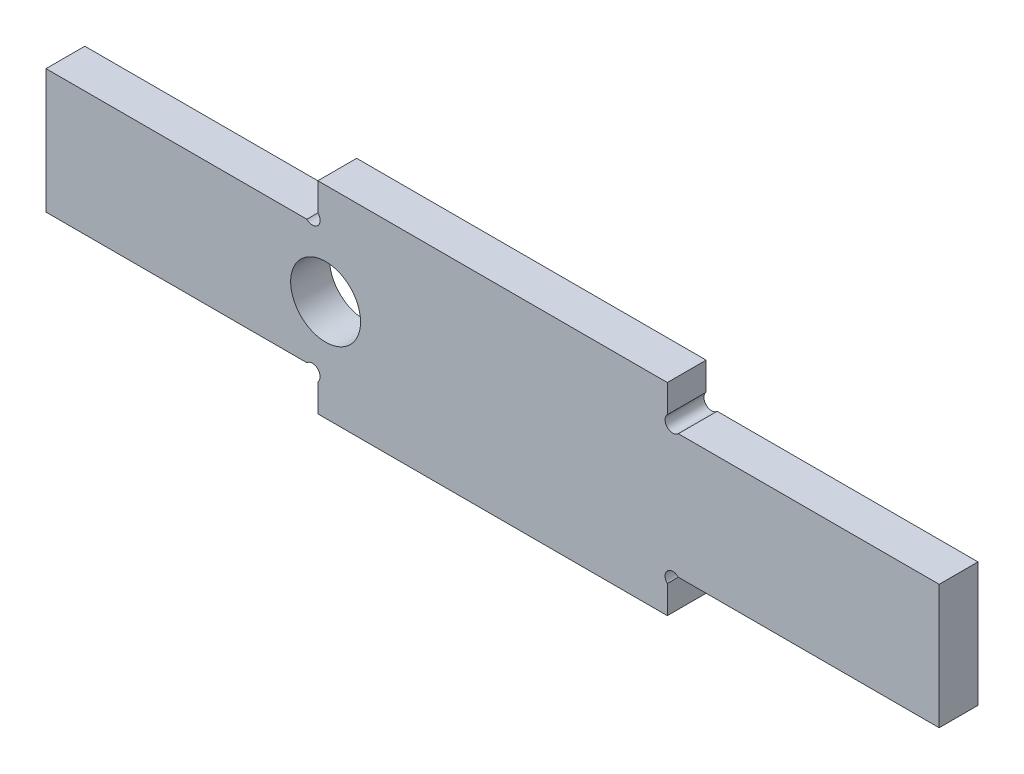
from build123d import *

# Parameters (mm, degrees)
ESQUISSE1_W             = 57.5
ESQUISSE1_H             = 26
BOSS_EXTRU_1_DEPTH      = 5
ENL_V_MAT_EXTRU_1_REACH = 65.303
ESQUISSE3_W             = 35
ESQUISSE3_H             = 5
ENL_V_START             = -5
ESQUISSE5_R             = 1
ENL_V_MAT_EXTRU_3_DEPTH = 5
ENL_V_MAT_EXTRU_2_REACH = 120.008
ESQUISSE4_R             = 4.5


with BuildPart() as part:
    # Esquisse1 → Boss.-Extru.1 (new body)
    with BuildSketch(Plane.XY):
        with Locations((28.75, 13)):
            Rectangle(ESQUISSE1_W, ESQUISSE1_H)
    boss_extru_1 = extrude(amount=BOSS_EXTRU_1_DEPTH)

    # Esquisse3 → Enl_v. mat.-Extru.1 (cut, up to next)
    with BuildSketch(Plane.XY.offset(5), mode=Mode.PRIVATE) as enl_v_mat_extru_1_sk1:
        with Locations((17.5, 23.5)):
            Rectangle(ESQUISSE3_W, ESQUISSE3_H)
    enl_v_mat_extru_1_tool1 = extrude(enl_v_mat_extru_1_sk1.sketch, amount=-ENL_V_MAT_EXTRU_1_REACH, mode=Mode.PRIVATE) & part.part
    # Esquisse3 → Enl_v. mat.-Extru.1 (cut, up to next)
    with BuildSketch(Plane.XY.offset(5), mode=Mode.PRIVATE) as enl_v_mat_extru_1_sk2:
        with Locations((17.5, 2.5)):
            Rectangle(ESQUISSE3_W, ESQUISSE3_H)
    enl_v_mat_extru_1_tool2 = extrude(enl_v_mat_extru_1_sk2.sketch, amount=-ENL_V_MAT_EXTRU_1_REACH, mode=Mode.PRIVATE) & part.part
    enl_v_mat_extru_1_1 = enl_v_mat_extru_1_tool1.solids().sort_by_distance((17.5, 23.5, 5))[0]
    add(enl_v_mat_extru_1_1, mode=Mode.SUBTRACT)
    enl_v_mat_extru_1_2 = enl_v_mat_extru_1_tool2.solids().sort_by_distance((17.5, 2.5, 5))[0]
    add(enl_v_mat_extru_1_2, mode=Mode.SUBTRACT)
    enl_v_mat_extru_1 = enl_v_mat_extru_1_1 + enl_v_mat_extru_1_2  # Enl_v. mat.-Extru.1 as one shape, for the pattern or mirror that repeats it

    # Esquisse5 → Enl_v. mat.-Extru.3 (cut)
    with BuildSketch(Plane.XY.offset(5).offset(ENL_V_START)):
        with Locations((34.292893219, 21.707106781)):
            Circle(ESQUISSE5_R)
        with Locations((34.292893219, 4.292893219)):
            Circle(ESQUISSE5_R)
    enl_v_mat_extru_3 = extrude(amount=ENL_V_MAT_EXTRU_3_DEPTH, mode=Mode.SUBTRACT)

    # Sym_trie1: Boss.-Extru.1, Enl_v. mat.-Extru.1, Enl_v. mat.-Extru.3 across plane
    add(boss_extru_1.mirror(Plane(origin=(57.5, 0, 5), x_dir=(0, 0, 1), z_dir=(-1, 0, 0))))
    add(enl_v_mat_extru_1.mirror(Plane(origin=(57.5, 0, 5), x_dir=(0, 0, 1), z_dir=(-1, 0, 0))), mode=Mode.SUBTRACT)
    add(enl_v_mat_extru_3.mirror(Plane(origin=(57.5, 0, 5), x_dir=(0, 0, 1), z_dir=(-1, 0, 0))), mode=Mode.SUBTRACT)

    # Esquisse4 → Enl_v. mat.-Extru.2 (cut, up to next)
    with BuildSketch(Plane.XY.offset(5), mode=Mode.PRIVATE) as enl_v_mat_extru_2_sk1:
        with Locations((36, 13)):
            Circle(ESQUISSE4_R)
    enl_v_mat_extru_2_tool1 = extrude(enl_v_mat_extru_2_sk1.sketch, amount=-ENL_V_MAT_EXTRU_2_REACH, mode=Mode.PRIVATE) & part.part
    add(enl_v_mat_extru_2_tool1.solids().sort_by_distance((36, 13, 5))[0], mode=Mode.SUBTRACT)


solid = part.part
